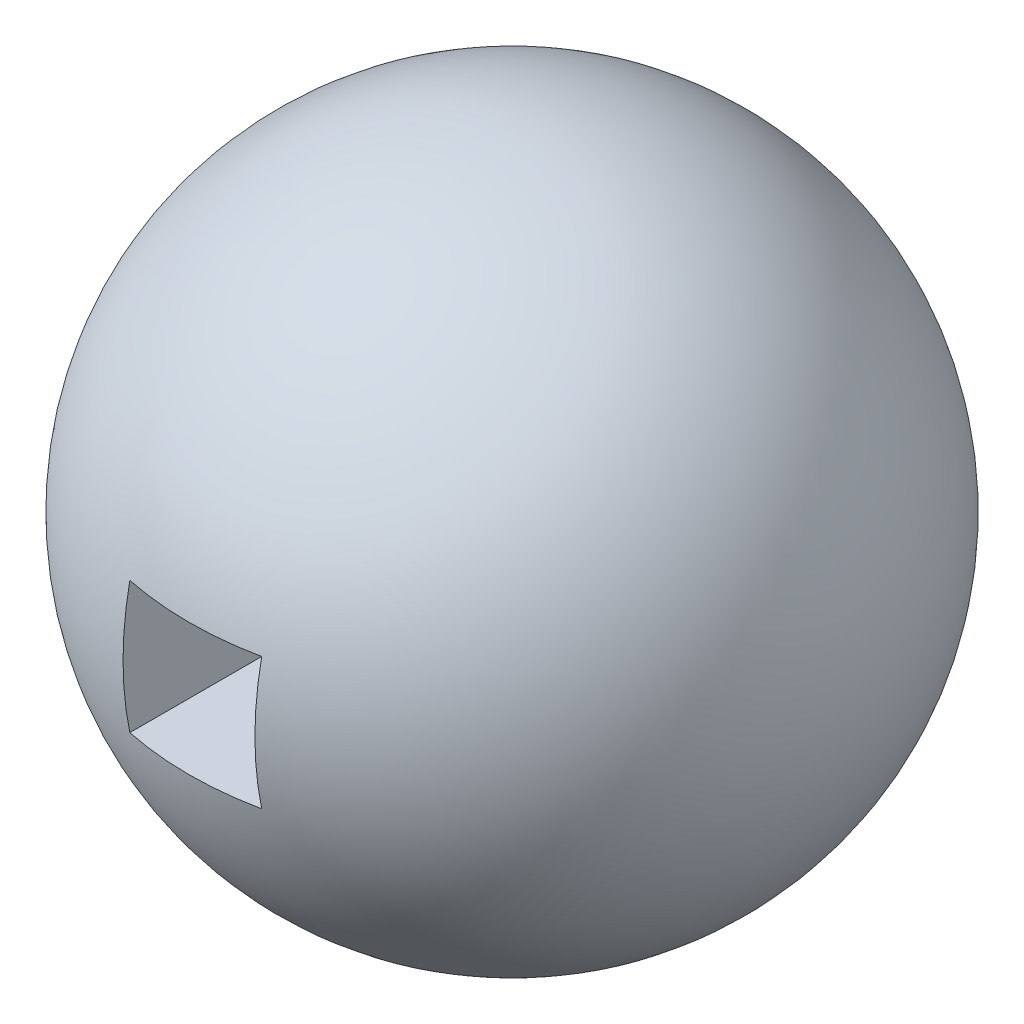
ISO-10303-21;
HEADER;
FILE_DESCRIPTION(('STEP AP214'),'2;1');
FILE_NAME('part.step','',(''),(''),'','','');
FILE_SCHEMA(('AUTOMOTIVE_DESIGN { 1 0 10303 214 1 1 1 1 }'));
ENDSEC;
DATA;
#1=APPLICATION_CONTEXT('core data for automotive mechanical design processes');
#2=APPLICATION_PROTOCOL_DEFINITION('international standard','automotive_design',2000,#1);
#3=PRODUCT_CONTEXT('',#1,'mechanical');
#4=PRODUCT('Part','Part','',(#3));
#5=PRODUCT_RELATED_PRODUCT_CATEGORY('part','',(#4));
#6=PRODUCT_DEFINITION_FORMATION('','',#4);
#7=PRODUCT_DEFINITION_CONTEXT('part definition',#1,'design');
#8=PRODUCT_DEFINITION('design','',#6,#7);
#9=PRODUCT_DEFINITION_SHAPE('','',#8);
#10=(LENGTH_UNIT() NAMED_UNIT(*) SI_UNIT(.MILLI.,.METRE.));
#11=(NAMED_UNIT(*) PLANE_ANGLE_UNIT() SI_UNIT($,.RADIAN.));
#12=(NAMED_UNIT(*) SI_UNIT($,.STERADIAN.) SOLID_ANGLE_UNIT());
#13=UNCERTAINTY_MEASURE_WITH_UNIT(LENGTH_MEASURE(1.E-05),#10,'distance_accuracy_value','');
#14=(GEOMETRIC_REPRESENTATION_CONTEXT(3) GLOBAL_UNCERTAINTY_ASSIGNED_CONTEXT((#13)) GLOBAL_UNIT_ASSIGNED_CONTEXT((#10,
#11,#12)) REPRESENTATION_CONTEXT('',''));
#15=CARTESIAN_POINT('',(0.,0.,0.));
#16=DIRECTION('',(0.,0.,1.));
#17=DIRECTION('',(1.,0.,0.));
#18=AXIS2_PLACEMENT_3D('',#15,#16,#17);
#19=CARTESIAN_POINT('',(-0.5,0.5,-2.501));
#20=DIRECTION('',(0.,1.,0.));
#21=DIRECTION('',(0.,0.,1.));
#22=AXIS2_PLACEMENT_3D('',#19,#20,#21);
#23=PLANE('',#22);
#24=DIRECTION('',(0.,0.,1.));
#25=VECTOR('',#24,1.);
#26=CARTESIAN_POINT('',(0.5,0.5,-2.501));
#27=LINE('',#26,#25);
#28=CARTESIAN_POINT('',(0.5,0.5,-2.39791576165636));
#29=VERTEX_POINT('',#28);
#30=CARTESIAN_POINT('',(0.5,0.5,2.39791576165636));
#31=VERTEX_POINT('',#30);
#32=EDGE_CURVE('E11',#29,#31,#27,.T.);
#33=ORIENTED_EDGE('',*,*,#32,.T.);
#34=CARTESIAN_POINT('',(0.,0.5,0.));
#35=DIRECTION('',(0.,-1.,0.));
#36=DIRECTION('',(0.,0.,-1.));
#37=AXIS2_PLACEMENT_3D('',#34,#35,#36);
#38=CIRCLE('',#37,2.44948974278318);
#39=CARTESIAN_POINT('',(-0.5,0.5,2.39791576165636));
#40=VERTEX_POINT('',#39);
#41=EDGE_CURVE('E89',#31,#40,#38,.T.);
#42=ORIENTED_EDGE('',*,*,#41,.T.);
#43=DIRECTION('',(0.,0.,1.));
#44=VECTOR('',#43,1.);
#45=CARTESIAN_POINT('',(-0.5,0.5,-2.501));
#46=LINE('',#45,#44);
#47=CARTESIAN_POINT('',(-0.5,0.5,-2.39791576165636));
#48=VERTEX_POINT('',#47);
#49=EDGE_CURVE('E84',#48,#40,#46,.T.);
#50=ORIENTED_EDGE('',*,*,#49,.F.);
#51=CARTESIAN_POINT('',(0.,0.5,0.));
#52=DIRECTION('',(0.,1.,0.));
#53=DIRECTION('',(0.,0.,1.));
#54=AXIS2_PLACEMENT_3D('',#51,#52,#53);
#55=CIRCLE('',#54,2.44948974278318);
#56=EDGE_CURVE('E88',#29,#48,#55,.T.);
#57=ORIENTED_EDGE('',*,*,#56,.F.);
#58=EDGE_LOOP('',(#33,#42,#50,#57));
#59=FACE_BOUND('',#58,.T.);
#60=ADVANCED_FACE('F33',(#59),#23,.F.);
#61=CARTESIAN_POINT('',(-0.5,-0.5,-2.501));
#62=DIRECTION('',(-1.,0.,0.));
#63=DIRECTION('',(0.,0.,1.));
#64=AXIS2_PLACEMENT_3D('',#61,#62,#63);
#65=PLANE('',#64);
#66=ORIENTED_EDGE('',*,*,#49,.T.);
#67=CARTESIAN_POINT('',(-0.5,0.,0.));
#68=DIRECTION('',(1.,0.,0.));
#69=DIRECTION('',(0.,0.,-1.));
#70=AXIS2_PLACEMENT_3D('',#67,#68,#69);
#71=CIRCLE('',#70,2.44948974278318);
#72=CARTESIAN_POINT('',(-0.5,-0.5,2.39791576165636));
#73=VERTEX_POINT('',#72);
#74=EDGE_CURVE('E81',#40,#73,#71,.T.);
#75=ORIENTED_EDGE('',*,*,#74,.T.);
#76=DIRECTION('',(0.,0.,1.));
#77=VECTOR('',#76,1.);
#78=CARTESIAN_POINT('',(-0.5,-0.5,-2.501));
#79=LINE('',#78,#77);
#80=CARTESIAN_POINT('',(-0.5,-0.5,-2.39791576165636));
#81=VERTEX_POINT('',#80);
#82=EDGE_CURVE('E71',#81,#73,#79,.T.);
#83=ORIENTED_EDGE('',*,*,#82,.F.);
#84=CARTESIAN_POINT('',(-0.5,0.,0.));
#85=DIRECTION('',(-1.,0.,0.));
#86=DIRECTION('',(0.,0.,1.));
#87=AXIS2_PLACEMENT_3D('',#84,#85,#86);
#88=CIRCLE('',#87,2.44948974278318);
#89=EDGE_CURVE('E78',#48,#81,#88,.T.);
#90=ORIENTED_EDGE('',*,*,#89,.F.);
#91=EDGE_LOOP('',(#66,#75,#83,#90));
#92=FACE_BOUND('',#91,.T.);
#93=ADVANCED_FACE('F82',(#92),#65,.F.);
#94=CARTESIAN_POINT('',(-0.5,-0.5,-2.501));
#95=DIRECTION('',(0.,-1.,0.));
#96=DIRECTION('',(0.,0.,-1.));
#97=AXIS2_PLACEMENT_3D('',#94,#95,#96);
#98=PLANE('',#97);
#99=ORIENTED_EDGE('',*,*,#82,.T.);
#100=CARTESIAN_POINT('',(0.,-0.5,0.));
#101=DIRECTION('',(0.,1.,0.));
#102=DIRECTION('',(0.,0.,1.));
#103=AXIS2_PLACEMENT_3D('',#100,#101,#102);
#104=CIRCLE('',#103,2.44948974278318);
#105=CARTESIAN_POINT('',(0.5,-0.5,2.39791576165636));
#106=VERTEX_POINT('',#105);
#107=EDGE_CURVE('E48',#73,#106,#104,.T.);
#108=ORIENTED_EDGE('',*,*,#107,.T.);
#109=DIRECTION('',(0.,0.,1.));
#110=VECTOR('',#109,1.);
#111=CARTESIAN_POINT('',(0.5,-0.5,-2.501));
#112=LINE('',#111,#110);
#113=CARTESIAN_POINT('',(0.5,-0.5,-2.39791576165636));
#114=VERTEX_POINT('',#113);
#115=EDGE_CURVE('E102',#114,#106,#112,.T.);
#116=ORIENTED_EDGE('',*,*,#115,.F.);
#117=CARTESIAN_POINT('',(0.,-0.5,0.));
#118=DIRECTION('',(0.,-1.,0.));
#119=DIRECTION('',(0.,0.,-1.));
#120=AXIS2_PLACEMENT_3D('',#117,#118,#119);
#121=CIRCLE('',#120,2.44948974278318);
#122=EDGE_CURVE('E75',#81,#114,#121,.T.);
#123=ORIENTED_EDGE('',*,*,#122,.F.);
#124=EDGE_LOOP('',(#99,#108,#116,#123));
#125=FACE_BOUND('',#124,.T.);
#126=ADVANCED_FACE('F73',(#125),#98,.F.);
#127=CARTESIAN_POINT('',(0.5,-0.5,-2.501));
#128=DIRECTION('',(1.,0.,0.));
#129=DIRECTION('',(0.,0.,-1.));
#130=AXIS2_PLACEMENT_3D('',#127,#128,#129);
#131=PLANE('',#130);
#132=ORIENTED_EDGE('',*,*,#115,.T.);
#133=CARTESIAN_POINT('',(0.5,0.,0.));
#134=DIRECTION('',(-1.,0.,0.));
#135=DIRECTION('',(0.,0.,1.));
#136=AXIS2_PLACEMENT_3D('',#133,#134,#135);
#137=CIRCLE('',#136,2.44948974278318);
#138=EDGE_CURVE('E93',#106,#31,#137,.T.);
#139=ORIENTED_EDGE('',*,*,#138,.T.);
#140=ORIENTED_EDGE('',*,*,#32,.F.);
#141=CARTESIAN_POINT('',(0.5,0.,0.));
#142=DIRECTION('',(1.,0.,0.));
#143=DIRECTION('',(0.,0.,-1.));
#144=AXIS2_PLACEMENT_3D('',#141,#142,#143);
#145=CIRCLE('',#144,2.44948974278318);
#146=EDGE_CURVE('E41',#114,#29,#145,.T.);
#147=ORIENTED_EDGE('',*,*,#146,.F.);
#148=EDGE_LOOP('',(#132,#139,#140,#147));
#149=FACE_BOUND('',#148,.T.);
#150=ADVANCED_FACE('F105',(#149),#131,.F.);
#151=CARTESIAN_POINT('',(0.,0.,0.));
#152=DIRECTION('',(0.,1.,0.));
#153=DIRECTION('',(1.,0.,0.));
#154=AXIS2_PLACEMENT_3D('',#151,#152,#153);
#155=SPHERICAL_SURFACE('',#154,2.5);
#156=ORIENTED_EDGE('',*,*,#41,.F.);
#157=ORIENTED_EDGE('',*,*,#138,.F.);
#158=ORIENTED_EDGE('',*,*,#107,.F.);
#159=ORIENTED_EDGE('',*,*,#74,.F.);
#160=EDGE_LOOP('',(#156,#157,#158,#159));
#161=FACE_BOUND('',#160,.T.);
#162=ORIENTED_EDGE('',*,*,#56,.T.);
#163=ORIENTED_EDGE('',*,*,#89,.T.);
#164=ORIENTED_EDGE('',*,*,#122,.T.);
#165=ORIENTED_EDGE('',*,*,#146,.T.);
#166=EDGE_LOOP('',(#162,#163,#164,#165));
#167=FACE_BOUND('',#166,.T.);
#168=ADVANCED_FACE('F35',(#161,#167),#155,.T.);
#169=CLOSED_SHELL('',(#60,#93,#126,#150,#168));
#170=MANIFOLD_SOLID_BREP('B2',#169);
#171=ADVANCED_BREP_SHAPE_REPRESENTATION('',(#18,#170),#14);
#172=SHAPE_DEFINITION_REPRESENTATION(#9,#171);
ENDSEC;
END-ISO-10303-21;
